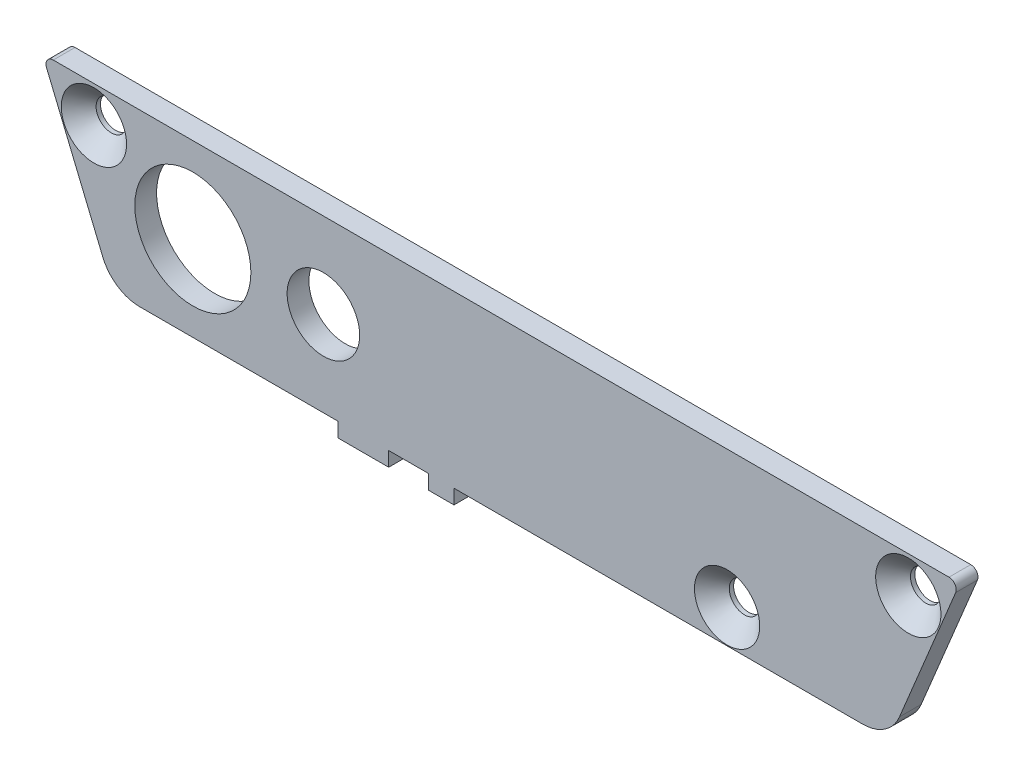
ISO-10303-21;
HEADER;
FILE_DESCRIPTION(('STEP AP214'),'2;1');
FILE_NAME('part.step','',(''),(''),'','','');
FILE_SCHEMA(('AUTOMOTIVE_DESIGN { 1 0 10303 214 1 1 1 1 }'));
ENDSEC;
DATA;
#1=APPLICATION_CONTEXT('core data for automotive mechanical design processes');
#2=APPLICATION_PROTOCOL_DEFINITION('international standard','automotive_design',2000,#1);
#3=PRODUCT_CONTEXT('',#1,'mechanical');
#4=PRODUCT('Part','Part','',(#3));
#5=PRODUCT_RELATED_PRODUCT_CATEGORY('part','',(#4));
#6=PRODUCT_DEFINITION_FORMATION('','',#4);
#7=PRODUCT_DEFINITION_CONTEXT('part definition',#1,'design');
#8=PRODUCT_DEFINITION('design','',#6,#7);
#9=PRODUCT_DEFINITION_SHAPE('','',#8);
#10=(LENGTH_UNIT() NAMED_UNIT(*) SI_UNIT(.MILLI.,.METRE.));
#11=(NAMED_UNIT(*) PLANE_ANGLE_UNIT() SI_UNIT($,.RADIAN.));
#12=(NAMED_UNIT(*) SI_UNIT($,.STERADIAN.) SOLID_ANGLE_UNIT());
#13=UNCERTAINTY_MEASURE_WITH_UNIT(LENGTH_MEASURE(1.E-05),#10,'distance_accuracy_value','');
#14=(GEOMETRIC_REPRESENTATION_CONTEXT(3) GLOBAL_UNCERTAINTY_ASSIGNED_CONTEXT((#13)) GLOBAL_UNIT_ASSIGNED_CONTEXT((#10,
#11,#12)) REPRESENTATION_CONTEXT('',''));
#15=CARTESIAN_POINT('',(0.,0.,0.));
#16=DIRECTION('',(0.,0.,1.));
#17=DIRECTION('',(1.,0.,0.));
#18=AXIS2_PLACEMENT_3D('',#15,#16,#17);
#19=CARTESIAN_POINT('',(130.529448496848,75.83614955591,131.349627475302));
#20=DIRECTION('',(0.,0.,1.));
#21=DIRECTION('',(1.,0.,0.));
#22=AXIS2_PLACEMENT_3D('',#19,#20,#21);
#23=CYLINDRICAL_SURFACE('',#22,0.999999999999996);
#24=CARTESIAN_POINT('',(130.529448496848,75.83614955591,134.349627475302));
#25=DIRECTION('',(0.,0.,1.));
#26=DIRECTION('',(1.,0.,0.));
#27=AXIS2_PLACEMENT_3D('',#24,#25,#26);
#28=CIRCLE('',#27,0.999999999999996);
#29=CARTESIAN_POINT('',(131.45332802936,75.4534661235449,134.349627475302));
#30=VERTEX_POINT('',#29);
#31=CARTESIAN_POINT('',(130.529448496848,76.83614955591,134.349627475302));
#32=VERTEX_POINT('',#31);
#33=EDGE_CURVE('E180',#30,#32,#28,.T.);
#34=ORIENTED_EDGE('',*,*,#33,.F.);
#35=DIRECTION('',(0.,0.,1.));
#36=VECTOR('',#35,1.);
#37=CARTESIAN_POINT('',(131.45332802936,75.4534661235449,131.349627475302));
#38=LINE('',#37,#36);
#39=CARTESIAN_POINT('',(131.45332802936,75.4534661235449,131.349627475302));
#40=VERTEX_POINT('',#39);
#41=EDGE_CURVE('E11',#40,#30,#38,.T.);
#42=ORIENTED_EDGE('',*,*,#41,.F.);
#43=CARTESIAN_POINT('',(130.529448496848,75.83614955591,131.349627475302));
#44=DIRECTION('',(0.,0.,1.));
#45=DIRECTION('',(1.,0.,0.));
#46=AXIS2_PLACEMENT_3D('',#43,#44,#45);
#47=CIRCLE('',#46,0.999999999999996);
#48=CARTESIAN_POINT('',(130.529448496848,76.83614955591,131.349627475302));
#49=VERTEX_POINT('',#48);
#50=EDGE_CURVE('E225',#40,#49,#47,.T.);
#51=ORIENTED_EDGE('',*,*,#50,.T.);
#52=DIRECTION('',(0.,0.,1.));
#53=VECTOR('',#52,1.);
#54=CARTESIAN_POINT('',(130.529448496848,76.83614955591,131.349627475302));
#55=LINE('',#54,#53);
#56=EDGE_CURVE('E38',#49,#32,#55,.T.);
#57=ORIENTED_EDGE('',*,*,#56,.T.);
#58=EDGE_LOOP('',(#34,#42,#51,#57));
#59=FACE_BOUND('',#58,.T.);
#60=ADVANCED_FACE('F35',(#59),#23,.T.);
#61=CARTESIAN_POINT('',(123.698390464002,56.7313906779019,131.349627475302));
#62=DIRECTION('',(0.923879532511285,-0.382683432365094,0.));
#63=DIRECTION('',(0.382683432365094,0.923879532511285,0.));
#64=AXIS2_PLACEMENT_3D('',#61,#62,#63);
#65=PLANE('',#64);
#66=DIRECTION('',(0.382683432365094,0.923879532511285,0.));
#67=VECTOR('',#66,1.);
#68=CARTESIAN_POINT('',(123.698390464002,56.7313906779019,134.349627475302));
#69=LINE('',#68,#67);
#70=CARTESIAN_POINT('',(123.698390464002,56.7313906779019,134.349627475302));
#71=VERTEX_POINT('',#70);
#72=EDGE_CURVE('E223',#71,#30,#69,.T.);
#73=ORIENTED_EDGE('',*,*,#72,.F.);
#74=DIRECTION('',(0.,0.,1.));
#75=VECTOR('',#74,1.);
#76=CARTESIAN_POINT('',(123.698390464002,56.7313906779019,131.349627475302));
#77=LINE('',#76,#75);
#78=CARTESIAN_POINT('',(123.698390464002,56.7313906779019,131.349627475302));
#79=VERTEX_POINT('',#78);
#80=EDGE_CURVE('E44',#79,#71,#77,.T.);
#81=ORIENTED_EDGE('',*,*,#80,.F.);
#82=DIRECTION('',(0.382683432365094,0.923879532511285,0.));
#83=VECTOR('',#82,1.);
#84=CARTESIAN_POINT('',(123.698390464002,56.7313906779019,131.349627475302));
#85=LINE('',#84,#83);
#86=EDGE_CURVE('E170',#79,#40,#85,.T.);
#87=ORIENTED_EDGE('',*,*,#86,.T.);
#88=ORIENTED_EDGE('',*,*,#41,.T.);
#89=EDGE_LOOP('',(#73,#81,#87,#88));
#90=FACE_BOUND('',#89,.T.);
#91=ADVANCED_FACE('F254',(#90),#65,.T.);
#92=CARTESIAN_POINT('',(118.61705303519,58.8361495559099,131.349627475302));
#93=DIRECTION('',(0.,0.,1.));
#94=DIRECTION('',(1.,0.,0.));
#95=AXIS2_PLACEMENT_3D('',#92,#93,#94);
#96=CYLINDRICAL_SURFACE('',#95,5.49999999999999);
#97=CARTESIAN_POINT('',(118.61705303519,58.8361495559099,134.349627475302));
#98=DIRECTION('',(0.,0.,1.));
#99=DIRECTION('',(1.,0.,0.));
#100=AXIS2_PLACEMENT_3D('',#97,#98,#99);
#101=CIRCLE('',#100,5.49999999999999);
#102=CARTESIAN_POINT('',(118.61705303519,53.33614955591,134.349627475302));
#103=VERTEX_POINT('',#102);
#104=EDGE_CURVE('E157',#103,#71,#101,.T.);
#105=ORIENTED_EDGE('',*,*,#104,.F.);
#106=DIRECTION('',(0.,0.,1.));
#107=VECTOR('',#106,1.);
#108=CARTESIAN_POINT('',(118.61705303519,53.33614955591,131.349627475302));
#109=LINE('',#108,#107);
#110=CARTESIAN_POINT('',(118.61705303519,53.33614955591,131.349627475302));
#111=VERTEX_POINT('',#110);
#112=EDGE_CURVE('E152',#111,#103,#109,.T.);
#113=ORIENTED_EDGE('',*,*,#112,.F.);
#114=CARTESIAN_POINT('',(118.61705303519,58.8361495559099,131.349627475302));
#115=DIRECTION('',(0.,0.,1.));
#116=DIRECTION('',(1.,0.,0.));
#117=AXIS2_PLACEMENT_3D('',#114,#115,#116);
#118=CIRCLE('',#117,5.49999999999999);
#119=EDGE_CURVE('E155',#111,#79,#118,.T.);
#120=ORIENTED_EDGE('',*,*,#119,.T.);
#121=ORIENTED_EDGE('',*,*,#80,.T.);
#122=EDGE_LOOP('',(#105,#113,#120,#121));
#123=FACE_BOUND('',#122,.T.);
#124=ADVANCED_FACE('F154',(#123),#96,.T.);
#125=CARTESIAN_POINT('',(62.2839844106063,53.33614955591,131.349627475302));
#126=DIRECTION('',(0.,-1.,0.));
#127=DIRECTION('',(0.,0.,-1.));
#128=AXIS2_PLACEMENT_3D('',#125,#126,#127);
#129=PLANE('',#128);
#130=DIRECTION('',(1.,0.,0.));
#131=VECTOR('',#130,1.);
#132=CARTESIAN_POINT('',(62.2839844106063,53.33614955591,134.349627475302));
#133=LINE('',#132,#131);
#134=CARTESIAN_POINT('',(62.2839844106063,53.33614955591,134.349627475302));
#135=VERTEX_POINT('',#134);
#136=EDGE_CURVE('E220',#135,#103,#133,.T.);
#137=ORIENTED_EDGE('',*,*,#136,.F.);
#138=DIRECTION('',(0.,0.,1.));
#139=VECTOR('',#138,1.);
#140=CARTESIAN_POINT('',(62.2839844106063,53.33614955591,131.349627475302));
#141=LINE('',#140,#139);
#142=CARTESIAN_POINT('',(62.2839844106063,53.33614955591,131.349627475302));
#143=VERTEX_POINT('',#142);
#144=EDGE_CURVE('E162',#143,#135,#141,.T.);
#145=ORIENTED_EDGE('',*,*,#144,.F.);
#146=DIRECTION('',(1.,0.,0.));
#147=VECTOR('',#146,1.);
#148=CARTESIAN_POINT('',(62.2839844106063,53.33614955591,131.349627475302));
#149=LINE('',#148,#147);
#150=EDGE_CURVE('E168',#143,#111,#149,.T.);
#151=ORIENTED_EDGE('',*,*,#150,.T.);
#152=ORIENTED_EDGE('',*,*,#112,.T.);
#153=EDGE_LOOP('',(#137,#145,#151,#152));
#154=FACE_BOUND('',#153,.T.);
#155=ADVANCED_FACE('F172',(#154),#129,.T.);
#156=CARTESIAN_POINT('',(62.2839844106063,53.33614955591,131.349627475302));
#157=DIRECTION('',(1.,0.,0.));
#158=DIRECTION('',(0.,0.,-1.));
#159=AXIS2_PLACEMENT_3D('',#156,#157,#158);
#160=PLANE('',#159);
#161=DIRECTION('',(0.,1.,0.));
#162=VECTOR('',#161,1.);
#163=CARTESIAN_POINT('',(62.2839844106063,53.33614955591,134.349627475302));
#164=LINE('',#163,#162);
#165=CARTESIAN_POINT('',(62.2839844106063,51.33614955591,134.349627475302));
#166=VERTEX_POINT('',#165);
#167=EDGE_CURVE('E217',#166,#135,#164,.T.);
#168=ORIENTED_EDGE('',*,*,#167,.F.);
#169=DIRECTION('',(0.,0.,1.));
#170=VECTOR('',#169,1.);
#171=CARTESIAN_POINT('',(62.2839844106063,51.33614955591,131.349627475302));
#172=LINE('',#171,#170);
#173=CARTESIAN_POINT('',(62.2839844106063,51.33614955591,131.349627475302));
#174=VERTEX_POINT('',#173);
#175=EDGE_CURVE('E229',#174,#166,#172,.T.);
#176=ORIENTED_EDGE('',*,*,#175,.F.);
#177=DIRECTION('',(0.,1.,0.));
#178=VECTOR('',#177,1.);
#179=CARTESIAN_POINT('',(62.2839844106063,53.33614955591,131.349627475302));
#180=LINE('',#179,#178);
#181=EDGE_CURVE('E173',#174,#143,#180,.T.);
#182=ORIENTED_EDGE('',*,*,#181,.T.);
#183=ORIENTED_EDGE('',*,*,#144,.T.);
#184=EDGE_LOOP('',(#168,#176,#182,#183));
#185=FACE_BOUND('',#184,.T.);
#186=ADVANCED_FACE('F267',(#185),#160,.T.);
#187=CARTESIAN_POINT('',(58.7839844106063,51.33614955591,131.349627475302));
#188=DIRECTION('',(0.,-1.,0.));
#189=DIRECTION('',(0.,0.,-1.));
#190=AXIS2_PLACEMENT_3D('',#187,#188,#189);
#191=PLANE('',#190);
#192=DIRECTION('',(1.,0.,0.));
#193=VECTOR('',#192,1.);
#194=CARTESIAN_POINT('',(58.7839844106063,51.33614955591,134.349627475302));
#195=LINE('',#194,#193);
#196=CARTESIAN_POINT('',(58.7839844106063,51.33614955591,134.349627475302));
#197=VERTEX_POINT('',#196);
#198=EDGE_CURVE('E214',#197,#166,#195,.T.);
#199=ORIENTED_EDGE('',*,*,#198,.F.);
#200=DIRECTION('',(0.,0.,1.));
#201=VECTOR('',#200,1.);
#202=CARTESIAN_POINT('',(58.7839844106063,51.33614955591,131.349627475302));
#203=LINE('',#202,#201);
#204=CARTESIAN_POINT('',(58.7839844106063,51.33614955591,131.349627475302));
#205=VERTEX_POINT('',#204);
#206=EDGE_CURVE('E231',#205,#197,#203,.T.);
#207=ORIENTED_EDGE('',*,*,#206,.F.);
#208=DIRECTION('',(1.,0.,0.));
#209=VECTOR('',#208,1.);
#210=CARTESIAN_POINT('',(58.7839844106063,51.33614955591,131.349627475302));
#211=LINE('',#210,#209);
#212=EDGE_CURVE('E175',#205,#174,#211,.T.);
#213=ORIENTED_EDGE('',*,*,#212,.T.);
#214=ORIENTED_EDGE('',*,*,#175,.T.);
#215=EDGE_LOOP('',(#199,#207,#213,#214));
#216=FACE_BOUND('',#215,.T.);
#217=ADVANCED_FACE('F270',(#216),#191,.T.);
#218=CARTESIAN_POINT('',(58.7839844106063,53.33614955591,131.349627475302));
#219=DIRECTION('',(-1.,0.,0.));
#220=DIRECTION('',(0.,-1.,0.));
#221=AXIS2_PLACEMENT_3D('',#218,#219,#220);
#222=PLANE('',#221);
#223=DIRECTION('',(0.,-1.,0.));
#224=VECTOR('',#223,1.);
#225=CARTESIAN_POINT('',(58.7839844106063,53.33614955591,134.349627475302));
#226=LINE('',#225,#224);
#227=CARTESIAN_POINT('',(58.7839844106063,53.33614955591,134.349627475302));
#228=VERTEX_POINT('',#227);
#229=EDGE_CURVE('E211',#228,#197,#226,.T.);
#230=ORIENTED_EDGE('',*,*,#229,.F.);
#231=DIRECTION('',(0.,0.,1.));
#232=VECTOR('',#231,1.);
#233=CARTESIAN_POINT('',(58.7839844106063,53.33614955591,131.349627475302));
#234=LINE('',#233,#232);
#235=CARTESIAN_POINT('',(58.7839844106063,53.33614955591,131.349627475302));
#236=VERTEX_POINT('',#235);
#237=EDGE_CURVE('E233',#236,#228,#234,.T.);
#238=ORIENTED_EDGE('',*,*,#237,.F.);
#239=DIRECTION('',(0.,-1.,0.));
#240=VECTOR('',#239,1.);
#241=CARTESIAN_POINT('',(58.7839844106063,53.33614955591,131.349627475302));
#242=LINE('',#241,#240);
#243=EDGE_CURVE('E422',#236,#205,#242,.T.);
#244=ORIENTED_EDGE('',*,*,#243,.T.);
#245=ORIENTED_EDGE('',*,*,#206,.T.);
#246=EDGE_LOOP('',(#230,#238,#244,#245));
#247=FACE_BOUND('',#246,.T.);
#248=ADVANCED_FACE('F274',(#247),#222,.T.);
#249=CARTESIAN_POINT('',(53.2839844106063,53.33614955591,131.349627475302));
#250=DIRECTION('',(0.,-1.,0.));
#251=DIRECTION('',(0.,0.,-1.));
#252=AXIS2_PLACEMENT_3D('',#249,#250,#251);
#253=PLANE('',#252);
#254=DIRECTION('',(1.,0.,0.));
#255=VECTOR('',#254,1.);
#256=CARTESIAN_POINT('',(53.2839844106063,53.33614955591,134.349627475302));
#257=LINE('',#256,#255);
#258=CARTESIAN_POINT('',(53.2839844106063,53.33614955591,134.349627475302));
#259=VERTEX_POINT('',#258);
#260=EDGE_CURVE('E208',#259,#228,#257,.T.);
#261=ORIENTED_EDGE('',*,*,#260,.F.);
#262=DIRECTION('',(0.,0.,1.));
#263=VECTOR('',#262,1.);
#264=CARTESIAN_POINT('',(53.2839844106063,53.33614955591,131.349627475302));
#265=LINE('',#264,#263);
#266=CARTESIAN_POINT('',(53.2839844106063,53.33614955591,131.349627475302));
#267=VERTEX_POINT('',#266);
#268=EDGE_CURVE('E235',#267,#259,#265,.T.);
#269=ORIENTED_EDGE('',*,*,#268,.F.);
#270=DIRECTION('',(1.,0.,0.));
#271=VECTOR('',#270,1.);
#272=CARTESIAN_POINT('',(53.2839844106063,53.33614955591,131.349627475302));
#273=LINE('',#272,#271);
#274=EDGE_CURVE('E419',#267,#236,#273,.T.);
#275=ORIENTED_EDGE('',*,*,#274,.T.);
#276=ORIENTED_EDGE('',*,*,#237,.T.);
#277=EDGE_LOOP('',(#261,#269,#275,#276));
#278=FACE_BOUND('',#277,.T.);
#279=ADVANCED_FACE('F278',(#278),#253,.T.);
#280=CARTESIAN_POINT('',(53.2839844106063,51.33614955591,131.349627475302));
#281=DIRECTION('',(1.,0.,0.));
#282=DIRECTION('',(0.,0.,-1.));
#283=AXIS2_PLACEMENT_3D('',#280,#281,#282);
#284=PLANE('',#283);
#285=DIRECTION('',(0.,1.,0.));
#286=VECTOR('',#285,1.);
#287=CARTESIAN_POINT('',(53.2839844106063,51.33614955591,134.349627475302));
#288=LINE('',#287,#286);
#289=CARTESIAN_POINT('',(53.2839844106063,51.33614955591,134.349627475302));
#290=VERTEX_POINT('',#289);
#291=EDGE_CURVE('E205',#290,#259,#288,.T.);
#292=ORIENTED_EDGE('',*,*,#291,.F.);
#293=DIRECTION('',(0.,0.,1.));
#294=VECTOR('',#293,1.);
#295=CARTESIAN_POINT('',(53.2839844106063,51.33614955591,131.349627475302));
#296=LINE('',#295,#294);
#297=CARTESIAN_POINT('',(53.2839844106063,51.33614955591,131.349627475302));
#298=VERTEX_POINT('',#297);
#299=EDGE_CURVE('E237',#298,#290,#296,.T.);
#300=ORIENTED_EDGE('',*,*,#299,.F.);
#301=DIRECTION('',(0.,1.,0.));
#302=VECTOR('',#301,1.);
#303=CARTESIAN_POINT('',(53.2839844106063,51.33614955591,131.349627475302));
#304=LINE('',#303,#302);
#305=EDGE_CURVE('E416',#298,#267,#304,.T.);
#306=ORIENTED_EDGE('',*,*,#305,.T.);
#307=ORIENTED_EDGE('',*,*,#268,.T.);
#308=EDGE_LOOP('',(#292,#300,#306,#307));
#309=FACE_BOUND('',#308,.T.);
#310=ADVANCED_FACE('F282',(#309),#284,.T.);
#311=CARTESIAN_POINT('',(46.2839844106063,51.33614955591,131.349627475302));
#312=DIRECTION('',(0.,-1.,0.));
#313=DIRECTION('',(0.,0.,-1.));
#314=AXIS2_PLACEMENT_3D('',#311,#312,#313);
#315=PLANE('',#314);
#316=DIRECTION('',(1.,0.,0.));
#317=VECTOR('',#316,1.);
#318=CARTESIAN_POINT('',(46.2839844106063,51.33614955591,134.349627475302));
#319=LINE('',#318,#317);
#320=CARTESIAN_POINT('',(46.2839844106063,51.33614955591,134.349627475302));
#321=VERTEX_POINT('',#320);
#322=EDGE_CURVE('E202',#321,#290,#319,.T.);
#323=ORIENTED_EDGE('',*,*,#322,.F.);
#324=DIRECTION('',(0.,0.,1.));
#325=VECTOR('',#324,1.);
#326=CARTESIAN_POINT('',(46.2839844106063,51.33614955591,131.349627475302));
#327=LINE('',#326,#325);
#328=CARTESIAN_POINT('',(46.2839844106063,51.33614955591,131.349627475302));
#329=VERTEX_POINT('',#328);
#330=EDGE_CURVE('E239',#329,#321,#327,.T.);
#331=ORIENTED_EDGE('',*,*,#330,.F.);
#332=DIRECTION('',(1.,0.,0.));
#333=VECTOR('',#332,1.);
#334=CARTESIAN_POINT('',(46.2839844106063,51.33614955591,131.349627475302));
#335=LINE('',#334,#333);
#336=EDGE_CURVE('E413',#329,#298,#335,.T.);
#337=ORIENTED_EDGE('',*,*,#336,.T.);
#338=ORIENTED_EDGE('',*,*,#299,.T.);
#339=EDGE_LOOP('',(#323,#331,#337,#338));
#340=FACE_BOUND('',#339,.T.);
#341=ADVANCED_FACE('F286',(#340),#315,.T.);
#342=CARTESIAN_POINT('',(46.2839844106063,53.33614955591,131.349627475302));
#343=DIRECTION('',(-1.,0.,0.));
#344=DIRECTION('',(0.,0.,1.));
#345=AXIS2_PLACEMENT_3D('',#342,#343,#344);
#346=PLANE('',#345);
#347=DIRECTION('',(0.,-1.,0.));
#348=VECTOR('',#347,1.);
#349=CARTESIAN_POINT('',(46.2839844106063,53.33614955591,134.349627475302));
#350=LINE('',#349,#348);
#351=CARTESIAN_POINT('',(46.2839844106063,53.33614955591,134.349627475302));
#352=VERTEX_POINT('',#351);
#353=EDGE_CURVE('E199',#352,#321,#350,.T.);
#354=ORIENTED_EDGE('',*,*,#353,.F.);
#355=DIRECTION('',(0.,0.,1.));
#356=VECTOR('',#355,1.);
#357=CARTESIAN_POINT('',(46.2839844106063,53.33614955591,131.349627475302));
#358=LINE('',#357,#356);
#359=CARTESIAN_POINT('',(46.2839844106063,53.33614955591,131.349627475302));
#360=VERTEX_POINT('',#359);
#361=EDGE_CURVE('E241',#360,#352,#358,.T.);
#362=ORIENTED_EDGE('',*,*,#361,.F.);
#363=DIRECTION('',(0.,-1.,0.));
#364=VECTOR('',#363,1.);
#365=CARTESIAN_POINT('',(46.2839844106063,53.33614955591,131.349627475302));
#366=LINE('',#365,#364);
#367=EDGE_CURVE('E410',#360,#329,#366,.T.);
#368=ORIENTED_EDGE('',*,*,#367,.T.);
#369=ORIENTED_EDGE('',*,*,#330,.T.);
#370=EDGE_LOOP('',(#354,#362,#368,#369));
#371=FACE_BOUND('',#370,.T.);
#372=ADVANCED_FACE('F290',(#371),#346,.T.);
#373=CARTESIAN_POINT('',(18.9509157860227,53.33614955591,131.349627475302));
#374=DIRECTION('',(0.,-1.,0.));
#375=DIRECTION('',(0.,0.,-1.));
#376=AXIS2_PLACEMENT_3D('',#373,#374,#375);
#377=PLANE('',#376);
#378=DIRECTION('',(1.,0.,0.));
#379=VECTOR('',#378,1.);
#380=CARTESIAN_POINT('',(18.9509157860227,53.33614955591,134.349627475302));
#381=LINE('',#380,#379);
#382=CARTESIAN_POINT('',(18.9509157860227,53.33614955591,134.349627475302));
#383=VERTEX_POINT('',#382);
#384=EDGE_CURVE('E196',#383,#352,#381,.T.);
#385=ORIENTED_EDGE('',*,*,#384,.F.);
#386=DIRECTION('',(0.,0.,1.));
#387=VECTOR('',#386,1.);
#388=CARTESIAN_POINT('',(18.9509157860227,53.33614955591,131.349627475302));
#389=LINE('',#388,#387);
#390=CARTESIAN_POINT('',(18.9509157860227,53.33614955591,131.349627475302));
#391=VERTEX_POINT('',#390);
#392=EDGE_CURVE('E243',#391,#383,#389,.T.);
#393=ORIENTED_EDGE('',*,*,#392,.F.);
#394=DIRECTION('',(1.,0.,0.));
#395=VECTOR('',#394,1.);
#396=CARTESIAN_POINT('',(18.9509157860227,53.33614955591,131.349627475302));
#397=LINE('',#396,#395);
#398=EDGE_CURVE('E407',#391,#360,#397,.T.);
#399=ORIENTED_EDGE('',*,*,#398,.T.);
#400=ORIENTED_EDGE('',*,*,#361,.T.);
#401=EDGE_LOOP('',(#385,#393,#399,#400));
#402=FACE_BOUND('',#401,.T.);
#403=ADVANCED_FACE('F294',(#402),#377,.T.);
#404=CARTESIAN_POINT('',(18.9509157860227,58.8361495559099,131.349627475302));
#405=DIRECTION('',(0.,0.,1.));
#406=DIRECTION('',(1.,0.,0.));
#407=AXIS2_PLACEMENT_3D('',#404,#405,#406);
#408=CYLINDRICAL_SURFACE('',#407,5.49999999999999);
#409=CARTESIAN_POINT('',(18.9509157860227,58.8361495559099,134.349627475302));
#410=DIRECTION('',(0.,0.,1.));
#411=DIRECTION('',(1.,0.,0.));
#412=AXIS2_PLACEMENT_3D('',#409,#410,#411);
#413=CIRCLE('',#412,5.49999999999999);
#414=CARTESIAN_POINT('',(13.8695783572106,56.7313906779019,134.349627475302));
#415=VERTEX_POINT('',#414);
#416=EDGE_CURVE('E193',#415,#383,#413,.T.);
#417=ORIENTED_EDGE('',*,*,#416,.F.);
#418=DIRECTION('',(0.,0.,1.));
#419=VECTOR('',#418,1.);
#420=CARTESIAN_POINT('',(13.8695783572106,56.7313906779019,131.349627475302));
#421=LINE('',#420,#419);
#422=CARTESIAN_POINT('',(13.8695783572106,56.7313906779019,131.349627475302));
#423=VERTEX_POINT('',#422);
#424=EDGE_CURVE('E245',#423,#415,#421,.T.);
#425=ORIENTED_EDGE('',*,*,#424,.F.);
#426=CARTESIAN_POINT('',(18.9509157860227,58.8361495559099,131.349627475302));
#427=DIRECTION('',(0.,0.,1.));
#428=DIRECTION('',(1.,0.,0.));
#429=AXIS2_PLACEMENT_3D('',#426,#427,#428);
#430=CIRCLE('',#429,5.49999999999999);
#431=EDGE_CURVE('E405',#423,#391,#430,.T.);
#432=ORIENTED_EDGE('',*,*,#431,.T.);
#433=ORIENTED_EDGE('',*,*,#392,.T.);
#434=EDGE_LOOP('',(#417,#425,#432,#433));
#435=FACE_BOUND('',#434,.T.);
#436=ADVANCED_FACE('F298',(#435),#408,.T.);
#437=CARTESIAN_POINT('',(6.11464079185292,75.4534661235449,131.349627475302));
#438=DIRECTION('',(-0.923879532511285,-0.382683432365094,0.));
#439=DIRECTION('',(0.382683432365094,-0.923879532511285,0.));
#440=AXIS2_PLACEMENT_3D('',#437,#438,#439);
#441=PLANE('',#440);
#442=DIRECTION('',(0.382683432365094,-0.923879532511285,0.));
#443=VECTOR('',#442,1.);
#444=CARTESIAN_POINT('',(6.11464079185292,75.4534661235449,134.349627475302));
#445=LINE('',#444,#443);
#446=CARTESIAN_POINT('',(6.11464079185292,75.4534661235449,134.349627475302));
#447=VERTEX_POINT('',#446);
#448=EDGE_CURVE('E190',#447,#415,#445,.T.);
#449=ORIENTED_EDGE('',*,*,#448,.F.);
#450=DIRECTION('',(0.,0.,1.));
#451=VECTOR('',#450,1.);
#452=CARTESIAN_POINT('',(6.11464079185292,75.4534661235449,131.349627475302));
#453=LINE('',#452,#451);
#454=CARTESIAN_POINT('',(6.11464079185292,75.4534661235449,131.349627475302));
#455=VERTEX_POINT('',#454);
#456=EDGE_CURVE('E248',#455,#447,#453,.T.);
#457=ORIENTED_EDGE('',*,*,#456,.F.);
#458=DIRECTION('',(0.382683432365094,-0.923879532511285,0.));
#459=VECTOR('',#458,1.);
#460=CARTESIAN_POINT('',(6.11464079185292,75.4534661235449,131.349627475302));
#461=LINE('',#460,#459);
#462=EDGE_CURVE('E402',#455,#423,#461,.T.);
#463=ORIENTED_EDGE('',*,*,#462,.T.);
#464=ORIENTED_EDGE('',*,*,#424,.T.);
#465=EDGE_LOOP('',(#449,#457,#463,#464));
#466=FACE_BOUND('',#465,.T.);
#467=ADVANCED_FACE('F302',(#466),#441,.T.);
#468=CARTESIAN_POINT('',(7.03852032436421,75.83614955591,131.349627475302));
#469=DIRECTION('',(0.,0.,1.));
#470=DIRECTION('',(1.,0.,0.));
#471=AXIS2_PLACEMENT_3D('',#468,#469,#470);
#472=CYLINDRICAL_SURFACE('',#471,1.);
#473=CARTESIAN_POINT('',(7.03852032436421,75.83614955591,134.349627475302));
#474=DIRECTION('',(0.,0.,1.));
#475=DIRECTION('',(1.,0.,0.));
#476=AXIS2_PLACEMENT_3D('',#473,#474,#475);
#477=CIRCLE('',#476,1.);
#478=CARTESIAN_POINT('',(7.03852032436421,76.83614955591,134.349627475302));
#479=VERTEX_POINT('',#478);
#480=EDGE_CURVE('E187',#479,#447,#477,.T.);
#481=ORIENTED_EDGE('',*,*,#480,.F.);
#482=DIRECTION('',(0.,0.,1.));
#483=VECTOR('',#482,1.);
#484=CARTESIAN_POINT('',(7.03852032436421,76.83614955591,131.349627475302));
#485=LINE('',#484,#483);
#486=CARTESIAN_POINT('',(7.03852032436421,76.83614955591,131.349627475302));
#487=VERTEX_POINT('',#486);
#488=EDGE_CURVE('E249',#487,#479,#485,.T.);
#489=ORIENTED_EDGE('',*,*,#488,.F.);
#490=CARTESIAN_POINT('',(7.03852032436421,75.83614955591,131.349627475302));
#491=DIRECTION('',(0.,0.,1.));
#492=DIRECTION('',(1.,0.,0.));
#493=AXIS2_PLACEMENT_3D('',#490,#491,#492);
#494=CIRCLE('',#493,1.);
#495=EDGE_CURVE('E399',#487,#455,#494,.T.);
#496=ORIENTED_EDGE('',*,*,#495,.T.);
#497=ORIENTED_EDGE('',*,*,#456,.T.);
#498=EDGE_LOOP('',(#481,#489,#496,#497));
#499=FACE_BOUND('',#498,.T.);
#500=ADVANCED_FACE('F306',(#499),#472,.T.);
#501=CARTESIAN_POINT('',(130.529448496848,76.83614955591,131.349627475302));
#502=DIRECTION('',(0.,1.,0.));
#503=DIRECTION('',(0.,0.,1.));
#504=AXIS2_PLACEMENT_3D('',#501,#502,#503);
#505=PLANE('',#504);
#506=DIRECTION('',(-1.,0.,0.));
#507=VECTOR('',#506,1.);
#508=CARTESIAN_POINT('',(130.529448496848,76.83614955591,134.349627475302));
#509=LINE('',#508,#507);
#510=EDGE_CURVE('E183',#32,#479,#509,.T.);
#511=ORIENTED_EDGE('',*,*,#510,.F.);
#512=ORIENTED_EDGE('',*,*,#56,.F.);
#513=DIRECTION('',(-1.,0.,0.));
#514=VECTOR('',#513,1.);
#515=CARTESIAN_POINT('',(130.529448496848,76.83614955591,131.349627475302));
#516=LINE('',#515,#514);
#517=EDGE_CURVE('E397',#49,#487,#516,.T.);
#518=ORIENTED_EDGE('',*,*,#517,.T.);
#519=ORIENTED_EDGE('',*,*,#488,.T.);
#520=EDGE_LOOP('',(#511,#512,#518,#519));
#521=FACE_BOUND('',#520,.T.);
#522=ADVANCED_FACE('F251',(#521),#505,.T.);
#523=CARTESIAN_POINT('',(130.529448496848,75.83614955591,131.349627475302));
#524=DIRECTION('',(0.,0.,1.));
#525=DIRECTION('',(1.,0.,0.));
#526=AXIS2_PLACEMENT_3D('',#523,#524,#525);
#527=PLANE('',#526);
#528=CARTESIAN_POINT('',(44.2839844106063,65.08614955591,131.349627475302));
#529=DIRECTION('',(0.,0.,1.));
#530=DIRECTION('',(1.,0.,0.));
#531=AXIS2_PLACEMENT_3D('',#528,#529,#530);
#532=CIRCLE('',#531,5.);
#533=CARTESIAN_POINT('',(49.2839844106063,65.08614955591,131.349627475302));
#534=VERTEX_POINT('',#533);
#535=EDGE_CURVE('E360',#534,#534,#532,.F.);
#536=ORIENTED_EDGE('',*,*,#535,.F.);
#537=EDGE_LOOP('',(#536));
#538=FACE_BOUND('',#537,.T.);
#539=CARTESIAN_POINT('',(26.2839844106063,65.08614955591,131.349627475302));
#540=DIRECTION('',(0.,0.,1.));
#541=DIRECTION('',(1.,0.,0.));
#542=AXIS2_PLACEMENT_3D('',#539,#540,#541);
#543=CIRCLE('',#542,8.00000000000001);
#544=CARTESIAN_POINT('',(34.2839844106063,65.08614955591,131.349627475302));
#545=VERTEX_POINT('',#544);
#546=EDGE_CURVE('E364',#545,#545,#543,.F.);
#547=ORIENTED_EDGE('',*,*,#546,.F.);
#548=EDGE_LOOP('',(#547));
#549=FACE_BOUND('',#548,.T.);
#550=CARTESIAN_POINT('',(12.6461061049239,71.8361495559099,131.349627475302));
#551=DIRECTION('',(0.,0.,1.));
#552=DIRECTION('',(1.,0.,0.));
#553=AXIS2_PLACEMENT_3D('',#550,#551,#552);
#554=CIRCLE('',#553,2.1);
#555=CARTESIAN_POINT('',(14.7461061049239,71.8361495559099,131.349627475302));
#556=VERTEX_POINT('',#555);
#557=EDGE_CURVE('E376',#556,#556,#554,.T.);
#558=ORIENTED_EDGE('',*,*,#557,.T.);
#559=EDGE_LOOP('',(#558));
#560=FACE_BOUND('',#559,.T.);
#561=CARTESIAN_POINT('',(99.9339844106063,57.93614955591,131.349627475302));
#562=DIRECTION('',(0.,0.,1.));
#563=DIRECTION('',(1.,0.,0.));
#564=AXIS2_PLACEMENT_3D('',#561,#562,#563);
#565=CIRCLE('',#564,2.1);
#566=CARTESIAN_POINT('',(102.033984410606,57.93614955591,131.349627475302));
#567=VERTEX_POINT('',#566);
#568=EDGE_CURVE('E385',#567,#567,#565,.T.);
#569=ORIENTED_EDGE('',*,*,#568,.T.);
#570=EDGE_LOOP('',(#569));
#571=FACE_BOUND('',#570,.T.);
#572=CARTESIAN_POINT('',(124.921862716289,71.8361495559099,131.349627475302));
#573=DIRECTION('',(0.,0.,1.));
#574=DIRECTION('',(1.,0.,0.));
#575=AXIS2_PLACEMENT_3D('',#572,#573,#574);
#576=CIRCLE('',#575,2.09999999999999);
#577=CARTESIAN_POINT('',(127.021862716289,71.8361495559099,131.349627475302));
#578=VERTEX_POINT('',#577);
#579=EDGE_CURVE('E184',#578,#578,#576,.T.);
#580=ORIENTED_EDGE('',*,*,#579,.T.);
#581=EDGE_LOOP('',(#580));
#582=FACE_BOUND('',#581,.T.);
#583=ORIENTED_EDGE('',*,*,#50,.F.);
#584=ORIENTED_EDGE('',*,*,#86,.F.);
#585=ORIENTED_EDGE('',*,*,#119,.F.);
#586=ORIENTED_EDGE('',*,*,#150,.F.);
#587=ORIENTED_EDGE('',*,*,#181,.F.);
#588=ORIENTED_EDGE('',*,*,#212,.F.);
#589=ORIENTED_EDGE('',*,*,#243,.F.);
#590=ORIENTED_EDGE('',*,*,#274,.F.);
#591=ORIENTED_EDGE('',*,*,#305,.F.);
#592=ORIENTED_EDGE('',*,*,#336,.F.);
#593=ORIENTED_EDGE('',*,*,#367,.F.);
#594=ORIENTED_EDGE('',*,*,#398,.F.);
#595=ORIENTED_EDGE('',*,*,#431,.F.);
#596=ORIENTED_EDGE('',*,*,#462,.F.);
#597=ORIENTED_EDGE('',*,*,#495,.F.);
#598=ORIENTED_EDGE('',*,*,#517,.F.);
#599=EDGE_LOOP('',(#583,#584,#585,#586,#587,#588,#589,#590,#591,#592,#593,#594,#595,#596,#597,#598));
#600=FACE_BOUND('',#599,.T.);
#601=ADVANCED_FACE('F166',(#538,#549,#560,#571,#582,#600),#527,.F.);
#602=CARTESIAN_POINT('',(130.529448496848,75.83614955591,134.349627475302));
#603=DIRECTION('',(0.,0.,1.));
#604=DIRECTION('',(1.,0.,0.));
#605=AXIS2_PLACEMENT_3D('',#602,#603,#604);
#606=PLANE('',#605);
#607=CARTESIAN_POINT('',(44.2839844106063,65.08614955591,134.349627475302));
#608=DIRECTION('',(0.,0.,1.));
#609=DIRECTION('',(1.,0.,0.));
#610=AXIS2_PLACEMENT_3D('',#607,#608,#609);
#611=CIRCLE('',#610,5.);
#612=CARTESIAN_POINT('',(49.2839844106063,65.08614955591,134.349627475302));
#613=VERTEX_POINT('',#612);
#614=EDGE_CURVE('E358',#613,#613,#611,.T.);
#615=ORIENTED_EDGE('',*,*,#614,.F.);
#616=EDGE_LOOP('',(#615));
#617=FACE_BOUND('',#616,.T.);
#618=CARTESIAN_POINT('',(26.2839844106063,65.08614955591,134.349627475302));
#619=DIRECTION('',(0.,0.,1.));
#620=DIRECTION('',(-1.,0.,0.));
#621=AXIS2_PLACEMENT_3D('',#618,#619,#620);
#622=CIRCLE('',#621,8.00000000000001);
#623=CARTESIAN_POINT('',(18.2839844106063,65.08614955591,134.349627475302));
#624=VERTEX_POINT('',#623);
#625=EDGE_CURVE('E361',#624,#624,#622,.T.);
#626=ORIENTED_EDGE('',*,*,#625,.F.);
#627=EDGE_LOOP('',(#626));
#628=FACE_BOUND('',#627,.T.);
#629=CARTESIAN_POINT('',(12.6461061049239,71.8361495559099,134.349627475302));
#630=DIRECTION('',(0.,0.,1.));
#631=DIRECTION('',(1.,0.,0.));
#632=AXIS2_PLACEMENT_3D('',#629,#630,#631);
#633=CIRCLE('',#632,4.5);
#634=CARTESIAN_POINT('',(17.1461061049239,71.8361495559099,134.349627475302));
#635=VERTEX_POINT('',#634);
#636=EDGE_CURVE('E370',#635,#635,#633,.T.);
#637=ORIENTED_EDGE('',*,*,#636,.F.);
#638=EDGE_LOOP('',(#637));
#639=FACE_BOUND('',#638,.T.);
#640=CARTESIAN_POINT('',(99.9339844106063,57.93614955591,134.349627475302));
#641=DIRECTION('',(0.,0.,1.));
#642=DIRECTION('',(1.,0.,0.));
#643=AXIS2_PLACEMENT_3D('',#640,#641,#642);
#644=CIRCLE('',#643,4.5);
#645=CARTESIAN_POINT('',(104.433984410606,57.93614955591,134.349627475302));
#646=VERTEX_POINT('',#645);
#647=EDGE_CURVE('E379',#646,#646,#644,.T.);
#648=ORIENTED_EDGE('',*,*,#647,.F.);
#649=EDGE_LOOP('',(#648));
#650=FACE_BOUND('',#649,.T.);
#651=CARTESIAN_POINT('',(124.921862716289,71.8361495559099,134.349627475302));
#652=DIRECTION('',(0.,0.,1.));
#653=DIRECTION('',(1.,0.,0.));
#654=AXIS2_PLACEMENT_3D('',#651,#652,#653);
#655=CIRCLE('',#654,4.5);
#656=CARTESIAN_POINT('',(129.421862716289,71.8361495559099,134.349627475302));
#657=VERTEX_POINT('',#656);
#658=EDGE_CURVE('E388',#657,#657,#655,.T.);
#659=ORIENTED_EDGE('',*,*,#658,.F.);
#660=EDGE_LOOP('',(#659));
#661=FACE_BOUND('',#660,.T.);
#662=ORIENTED_EDGE('',*,*,#33,.T.);
#663=ORIENTED_EDGE('',*,*,#510,.T.);
#664=ORIENTED_EDGE('',*,*,#480,.T.);
#665=ORIENTED_EDGE('',*,*,#448,.T.);
#666=ORIENTED_EDGE('',*,*,#416,.T.);
#667=ORIENTED_EDGE('',*,*,#384,.T.);
#668=ORIENTED_EDGE('',*,*,#353,.T.);
#669=ORIENTED_EDGE('',*,*,#322,.T.);
#670=ORIENTED_EDGE('',*,*,#291,.T.);
#671=ORIENTED_EDGE('',*,*,#260,.T.);
#672=ORIENTED_EDGE('',*,*,#229,.T.);
#673=ORIENTED_EDGE('',*,*,#198,.T.);
#674=ORIENTED_EDGE('',*,*,#167,.T.);
#675=ORIENTED_EDGE('',*,*,#136,.T.);
#676=ORIENTED_EDGE('',*,*,#104,.T.);
#677=ORIENTED_EDGE('',*,*,#72,.T.);
#678=EDGE_LOOP('',(#662,#663,#664,#665,#666,#667,#668,#669,#670,#671,#672,#673,#674,#675,#676,#677));
#679=FACE_BOUND('',#678,.T.);
#680=ADVANCED_FACE('F253',(#617,#628,#639,#650,#661,#679),#606,.T.);
#681=CARTESIAN_POINT('',(124.921862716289,71.8361495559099,134.349627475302));
#682=DIRECTION('',(0.,0.,1.));
#683=DIRECTION('',(1.,0.,0.));
#684=AXIS2_PLACEMENT_3D('',#681,#682,#683);
#685=CYLINDRICAL_SURFACE('',#684,2.09999999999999);
#686=ORIENTED_EDGE('',*,*,#579,.F.);
#687=EDGE_LOOP('',(#686));
#688=FACE_BOUND('',#687,.T.);
#689=CARTESIAN_POINT('',(124.921862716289,71.8361495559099,131.949627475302));
#690=DIRECTION('',(0.,0.,1.));
#691=DIRECTION('',(1.,0.,0.));
#692=AXIS2_PLACEMENT_3D('',#689,#690,#691);
#693=CIRCLE('',#692,2.09999999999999);
#694=CARTESIAN_POINT('',(127.021862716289,71.8361495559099,131.949627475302));
#695=VERTEX_POINT('',#694);
#696=EDGE_CURVE('E391',#695,#695,#693,.T.);
#697=ORIENTED_EDGE('',*,*,#696,.T.);
#698=EDGE_LOOP('',(#697));
#699=FACE_BOUND('',#698,.T.);
#700=ADVANCED_FACE('F318',(#688,#699),#685,.F.);
#701=CARTESIAN_POINT('',(124.921862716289,71.8361495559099,134.349627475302));
#702=DIRECTION('',(0.,0.,1.));
#703=DIRECTION('',(1.,0.,0.));
#704=AXIS2_PLACEMENT_3D('',#701,#702,#703);
#705=CONICAL_SURFACE('',#704,4.5,0.785398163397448);
#706=ORIENTED_EDGE('',*,*,#696,.F.);
#707=EDGE_LOOP('',(#706));
#708=FACE_BOUND('',#707,.T.);
#709=ORIENTED_EDGE('',*,*,#658,.T.);
#710=EDGE_LOOP('',(#709));
#711=FACE_BOUND('',#710,.T.);
#712=ADVANCED_FACE('F325',(#708,#711),#705,.F.);
#713=CARTESIAN_POINT('',(99.9339844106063,57.93614955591,134.349627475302));
#714=DIRECTION('',(0.,0.,1.));
#715=DIRECTION('',(1.,0.,0.));
#716=AXIS2_PLACEMENT_3D('',#713,#714,#715);
#717=CYLINDRICAL_SURFACE('',#716,2.1);
#718=ORIENTED_EDGE('',*,*,#568,.F.);
#719=EDGE_LOOP('',(#718));
#720=FACE_BOUND('',#719,.T.);
#721=CARTESIAN_POINT('',(99.9339844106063,57.93614955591,131.949627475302));
#722=DIRECTION('',(0.,0.,1.));
#723=DIRECTION('',(1.,0.,0.));
#724=AXIS2_PLACEMENT_3D('',#721,#722,#723);
#725=CIRCLE('',#724,2.1);
#726=CARTESIAN_POINT('',(102.033984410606,57.93614955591,131.949627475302));
#727=VERTEX_POINT('',#726);
#728=EDGE_CURVE('E382',#727,#727,#725,.T.);
#729=ORIENTED_EDGE('',*,*,#728,.T.);
#730=EDGE_LOOP('',(#729));
#731=FACE_BOUND('',#730,.T.);
#732=ADVANCED_FACE('F329',(#720,#731),#717,.F.);
#733=CARTESIAN_POINT('',(99.9339844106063,57.93614955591,134.349627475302));
#734=DIRECTION('',(0.,0.,1.));
#735=DIRECTION('',(1.,0.,0.));
#736=AXIS2_PLACEMENT_3D('',#733,#734,#735);
#737=CONICAL_SURFACE('',#736,4.5,0.785398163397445);
#738=ORIENTED_EDGE('',*,*,#728,.F.);
#739=EDGE_LOOP('',(#738));
#740=FACE_BOUND('',#739,.T.);
#741=ORIENTED_EDGE('',*,*,#647,.T.);
#742=EDGE_LOOP('',(#741));
#743=FACE_BOUND('',#742,.T.);
#744=ADVANCED_FACE('F333',(#740,#743),#737,.F.);
#745=CARTESIAN_POINT('',(12.6461061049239,71.8361495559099,134.349627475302));
#746=DIRECTION('',(0.,0.,1.));
#747=DIRECTION('',(1.,0.,0.));
#748=AXIS2_PLACEMENT_3D('',#745,#746,#747);
#749=CYLINDRICAL_SURFACE('',#748,2.1);
#750=ORIENTED_EDGE('',*,*,#557,.F.);
#751=EDGE_LOOP('',(#750));
#752=FACE_BOUND('',#751,.T.);
#753=CARTESIAN_POINT('',(12.6461061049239,71.8361495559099,131.949627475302));
#754=DIRECTION('',(0.,0.,1.));
#755=DIRECTION('',(1.,0.,0.));
#756=AXIS2_PLACEMENT_3D('',#753,#754,#755);
#757=CIRCLE('',#756,2.1);
#758=CARTESIAN_POINT('',(14.7461061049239,71.8361495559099,131.949627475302));
#759=VERTEX_POINT('',#758);
#760=EDGE_CURVE('E373',#759,#759,#757,.T.);
#761=ORIENTED_EDGE('',*,*,#760,.T.);
#762=EDGE_LOOP('',(#761));
#763=FACE_BOUND('',#762,.T.);
#764=ADVANCED_FACE('F337',(#752,#763),#749,.F.);
#765=CARTESIAN_POINT('',(12.6461061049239,71.8361495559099,134.349627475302));
#766=DIRECTION('',(0.,0.,1.));
#767=DIRECTION('',(1.,0.,0.));
#768=AXIS2_PLACEMENT_3D('',#765,#766,#767);
#769=CONICAL_SURFACE('',#768,4.5,0.785398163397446);
#770=ORIENTED_EDGE('',*,*,#760,.F.);
#771=EDGE_LOOP('',(#770));
#772=FACE_BOUND('',#771,.T.);
#773=ORIENTED_EDGE('',*,*,#636,.T.);
#774=EDGE_LOOP('',(#773));
#775=FACE_BOUND('',#774,.T.);
#776=ADVANCED_FACE('F341',(#772,#775),#769,.F.);
#777=CARTESIAN_POINT('',(26.2839844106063,65.08614955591,131.348627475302));
#778=DIRECTION('',(0.,0.,1.));
#779=DIRECTION('',(1.,0.,0.));
#780=AXIS2_PLACEMENT_3D('',#777,#778,#779);
#781=CYLINDRICAL_SURFACE('',#780,8.00000000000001);
#782=ORIENTED_EDGE('',*,*,#625,.T.);
#783=EDGE_LOOP('',(#782));
#784=FACE_BOUND('',#783,.T.);
#785=ORIENTED_EDGE('',*,*,#546,.T.);
#786=EDGE_LOOP('',(#785));
#787=FACE_BOUND('',#786,.T.);
#788=ADVANCED_FACE('F345',(#784,#787),#781,.F.);
#789=CARTESIAN_POINT('',(44.2839844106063,65.08614955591,131.348627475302));
#790=DIRECTION('',(0.,0.,1.));
#791=DIRECTION('',(1.,0.,0.));
#792=AXIS2_PLACEMENT_3D('',#789,#790,#791);
#793=CYLINDRICAL_SURFACE('',#792,5.);
#794=ORIENTED_EDGE('',*,*,#614,.T.);
#795=EDGE_LOOP('',(#794));
#796=FACE_BOUND('',#795,.T.);
#797=ORIENTED_EDGE('',*,*,#535,.T.);
#798=EDGE_LOOP('',(#797));
#799=FACE_BOUND('',#798,.T.);
#800=ADVANCED_FACE('F349',(#796,#799),#793,.F.);
#801=CLOSED_SHELL('',(#60,#91,#124,#155,#186,#217,#248,#279,#310,#341,#372,#403,#436,#467,#500,
#522,#601,#680,#700,#712,#732,#744,#764,#776,#788,#800));
#802=MANIFOLD_SOLID_BREP('B2',#801);
#803=ADVANCED_BREP_SHAPE_REPRESENTATION('',(#18,#802),#14);
#804=SHAPE_DEFINITION_REPRESENTATION(#9,#803);
ENDSEC;
END-ISO-10303-21;
